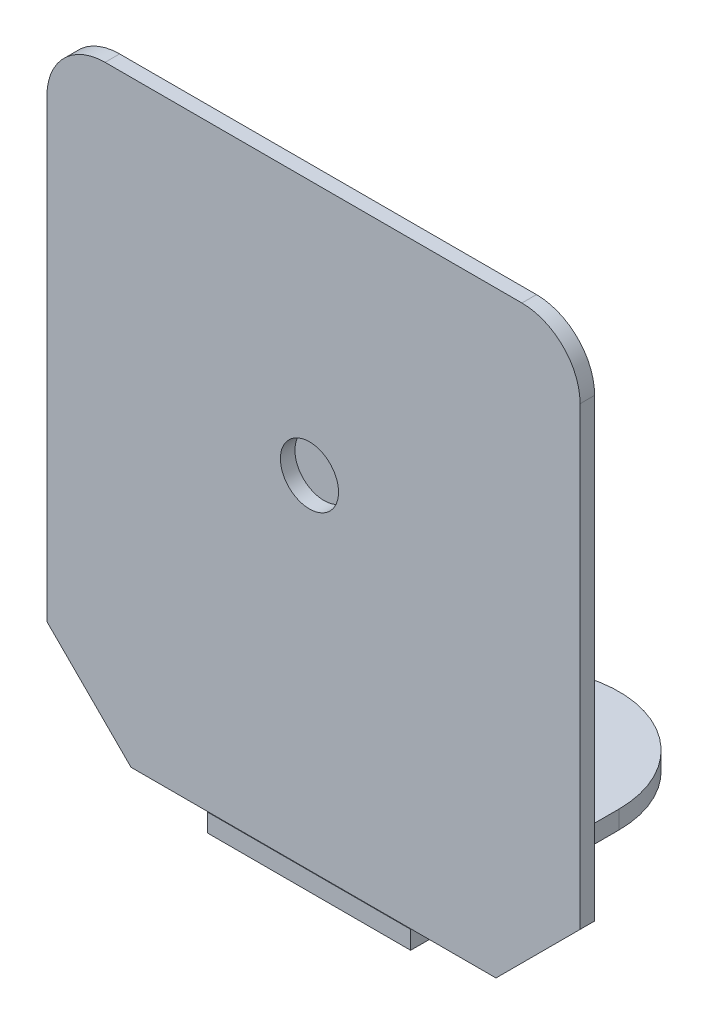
from build123d import *

# Parameters (mm, degrees)
ESQUISSE1_R      = 0.4
EXTRUSION1_DEPTH = 0.2
EXTRUSION3_DEPTH = 0.25
ESQUISSE4_R      = 1.728984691
EXTRUSION4_DEPTH = 0.4
EXTRUSION4_TAPER = 45


with BuildPart() as part:
    # Esquisse1 → Extrusion1 (new body)
    with BuildSketch(Plane.XY):
        with BuildLine():
            Line((9.879843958, -0.562534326), (8.722843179, -1.719535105))
            Line((8.722843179, -1.719535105), (3.702751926, -1.719535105))
            Line((3.702751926, -1.719535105), (2.545751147, -0.562534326))
            Line((2.545751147, -0.562534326), (2.545751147, 0))
            Line((2.545751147, 0), (2.545751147, 5.7))
            ThreePointArc((2.545751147, 5.7), (2.780065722, 6.265685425), (3.345751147, 6.5))
            Line((3.345751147, 6.5), (9.079843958, 6.5))
            ThreePointArc((9.079843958, 6.5), (9.645529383, 6.265685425), (9.879843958, 5.7))
            Line((9.879843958, 5.7), (9.879843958, -0.562534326))
        make_face()
        with Locations((6.157301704, 2.985169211)):
            Circle(ESQUISSE1_R, mode=Mode.SUBTRACT)
    extrude(amount=EXTRUSION1_DEPTH)

    # Esquisse3 → Extrusion3 (add)
    with BuildSketch(Plane.XZ.offset(1.719535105)):
        with BuildLine():
            Line((4.758443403, 0.20704744), (4.758443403, -2.659236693))
            ThreePointArc((4.758443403, -2.659236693), (6.157301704, -4.058094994), (7.556160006, -2.659236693))
            Line((7.556160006, -2.659236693), (7.556160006, 0.20704744))
            Line((7.556160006, 0.20704744), (4.758443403, 0.20704744))
        make_face()
    extrude(amount=EXTRUSION3_DEPTH)

    # Esquisse4 → Extrusion4 (add)
    with BuildSketch(Plane(origin=(0, 0, 0), x_dir=(-1, 0, 0), z_dir=(0, 0, -1))):
        with Locations((-6.194888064, 3.008463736)):
            Circle(ESQUISSE4_R)
    extrude(amount=EXTRUSION4_DEPTH, taper=EXTRUSION4_TAPER)


solid = part.part
